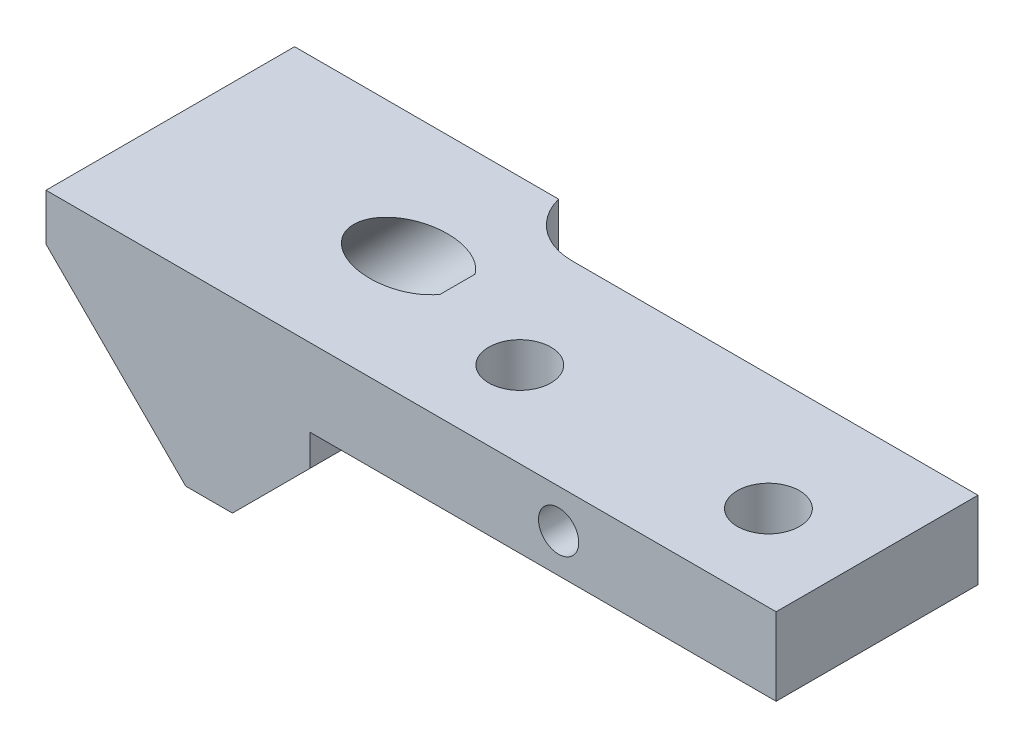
ISO-10303-21;
HEADER;
FILE_DESCRIPTION(('STEP AP214'),'2;1');
FILE_NAME('part.step','',(''),(''),'','','');
FILE_SCHEMA(('AUTOMOTIVE_DESIGN { 1 0 10303 214 1 1 1 1 }'));
ENDSEC;
DATA;
#1=APPLICATION_CONTEXT('core data for automotive mechanical design processes');
#2=APPLICATION_PROTOCOL_DEFINITION('international standard','automotive_design',2000,#1);
#3=PRODUCT_CONTEXT('',#1,'mechanical');
#4=PRODUCT('Part','Part','',(#3));
#5=PRODUCT_RELATED_PRODUCT_CATEGORY('part','',(#4));
#6=PRODUCT_DEFINITION_FORMATION('','',#4);
#7=PRODUCT_DEFINITION_CONTEXT('part definition',#1,'design');
#8=PRODUCT_DEFINITION('design','',#6,#7);
#9=PRODUCT_DEFINITION_SHAPE('','',#8);
#10=(LENGTH_UNIT() NAMED_UNIT(*) SI_UNIT(.MILLI.,.METRE.));
#11=(NAMED_UNIT(*) PLANE_ANGLE_UNIT() SI_UNIT($,.RADIAN.));
#12=(NAMED_UNIT(*) SI_UNIT($,.STERADIAN.) SOLID_ANGLE_UNIT());
#13=UNCERTAINTY_MEASURE_WITH_UNIT(LENGTH_MEASURE(1.E-05),#10,'distance_accuracy_value','');
#14=(GEOMETRIC_REPRESENTATION_CONTEXT(3) GLOBAL_UNCERTAINTY_ASSIGNED_CONTEXT((#13)) GLOBAL_UNIT_ASSIGNED_CONTEXT((#10,
#11,#12)) REPRESENTATION_CONTEXT('',''));
#15=CARTESIAN_POINT('',(0.,0.,0.));
#16=DIRECTION('',(0.,0.,1.));
#17=DIRECTION('',(1.,0.,0.));
#18=AXIS2_PLACEMENT_3D('',#15,#16,#17);
#19=CARTESIAN_POINT('',(0.,0.,12.7));
#20=DIRECTION('',(0.,0.,1.));
#21=DIRECTION('',(1.,0.,0.));
#22=AXIS2_PLACEMENT_3D('',#19,#20,#21);
#23=PLANE('',#22);
#24=DIRECTION('',(1.,0.,0.));
#25=VECTOR('',#24,1.);
#26=CARTESIAN_POINT('',(-47.625,-11.1252,12.7));
#27=LINE('',#26,#25);
#28=CARTESIAN_POINT('',(-60.325,-11.1252,12.7));
#29=VERTEX_POINT('',#28);
#30=CARTESIAN_POINT('',(-55.5498,-11.1252,12.7));
#31=VERTEX_POINT('',#30);
#32=EDGE_CURVE('E172',#29,#31,#27,.T.);
#33=ORIENTED_EDGE('',*,*,#32,.T.);
#34=DIRECTION('',(-0.707106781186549,-0.707106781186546,0.));
#35=VECTOR('',#34,1.);
#36=CARTESIAN_POINT('',(-22.2122999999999,22.2123,12.7));
#37=LINE('',#36,#35);
#38=CARTESIAN_POINT('',(-47.625,-3.20040000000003,12.7));
#39=VERTEX_POINT('',#38);
#40=EDGE_CURVE('E11',#31,#39,#37,.F.);
#41=ORIENTED_EDGE('',*,*,#40,.T.);
#42=DIRECTION('',(0.,1.,0.));
#43=VECTOR('',#42,1.);
#44=CARTESIAN_POINT('',(-47.625,0.,12.7));
#45=LINE('',#44,#43);
#46=CARTESIAN_POINT('',(-47.625,0.,12.7));
#47=VERTEX_POINT('',#46);
#48=EDGE_CURVE('E174',#39,#47,#45,.T.);
#49=ORIENTED_EDGE('',*,*,#48,.T.);
#50=DIRECTION('',(1.,0.,0.));
#51=VECTOR('',#50,1.);
#52=CARTESIAN_POINT('',(0.,0.,12.7));
#53=LINE('',#52,#51);
#54=CARTESIAN_POINT('',(0.,0.,12.7));
#55=VERTEX_POINT('',#54);
#56=EDGE_CURVE('E177',#47,#55,#53,.T.);
#57=ORIENTED_EDGE('',*,*,#56,.T.);
#58=DIRECTION('',(0.,1.,0.));
#59=VECTOR('',#58,1.);
#60=CARTESIAN_POINT('',(0.,7.9248,12.7));
#61=LINE('',#60,#59);
#62=CARTESIAN_POINT('',(0.,7.9248,12.7));
#63=VERTEX_POINT('',#62);
#64=EDGE_CURVE('E179',#55,#63,#61,.T.);
#65=ORIENTED_EDGE('',*,*,#64,.T.);
#66=DIRECTION('',(-1.,0.,0.));
#67=VECTOR('',#66,1.);
#68=CARTESIAN_POINT('',(-79.3750000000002,7.9248,12.7));
#69=LINE('',#68,#67);
#70=CARTESIAN_POINT('',(-74.5998000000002,7.9248,12.7));
#71=VERTEX_POINT('',#70);
#72=EDGE_CURVE('E181',#63,#71,#69,.T.);
#73=ORIENTED_EDGE('',*,*,#72,.T.);
#74=DIRECTION('',(0.,1.,0.));
#75=VECTOR('',#74,1.);
#76=CARTESIAN_POINT('',(-74.5998000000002,0.,12.7));
#77=LINE('',#76,#75);
#78=CARTESIAN_POINT('',(-74.5998000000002,3.14960000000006,12.7));
#79=VERTEX_POINT('',#78);
#80=EDGE_CURVE('E151',#79,#71,#77,.T.);
#81=ORIENTED_EDGE('',*,*,#80,.F.);
#82=DIRECTION('',(0.707106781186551,-0.707106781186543,0.));
#83=VECTOR('',#82,1.);
#84=CARTESIAN_POINT('',(-60.325,-11.1252,12.7));
#85=LINE('',#84,#83);
#86=EDGE_CURVE('E184',#79,#29,#85,.T.);
#87=ORIENTED_EDGE('',*,*,#86,.T.);
#88=EDGE_LOOP('',(#33,#41,#49,#57,#65,#73,#81,#87));
#89=FACE_BOUND('',#88,.T.);
#90=CARTESIAN_POINT('',(-22.225,3.9624,12.7));
#91=DIRECTION('',(0.,0.,1.));
#92=DIRECTION('',(1.,0.,0.));
#93=AXIS2_PLACEMENT_3D('',#90,#91,#92);
#94=CIRCLE('',#93,2.0574);
#95=CARTESIAN_POINT('',(-24.2824,3.9624,12.7));
#96=VERTEX_POINT('',#95);
#97=EDGE_CURVE('E138',#96,#96,#94,.F.);
#98=ORIENTED_EDGE('',*,*,#97,.T.);
#99=EDGE_LOOP('',(#98));
#100=FACE_BOUND('',#99,.T.);
#101=ADVANCED_FACE('F33',(#89,#100),#23,.T.);
#102=CARTESIAN_POINT('',(0.,0.,12.7));
#103=DIRECTION('',(0.,1.,0.));
#104=DIRECTION('',(-1.,0.,0.));
#105=AXIS2_PLACEMENT_3D('',#102,#103,#104);
#106=PLANE('',#105);
#107=CARTESIAN_POINT('',(-9.525,0.,3.9624));
#108=DIRECTION('',(0.,1.,0.));
#109=DIRECTION('',(-1.,0.,0.));
#110=AXIS2_PLACEMENT_3D('',#107,#108,#109);
#111=CIRCLE('',#110,3.175);
#112=CARTESIAN_POINT('',(-12.7,0.,3.9624));
#113=VERTEX_POINT('',#112);
#114=EDGE_CURVE('E160',#113,#113,#111,.T.);
#115=ORIENTED_EDGE('',*,*,#114,.T.);
#116=EDGE_LOOP('',(#115));
#117=FACE_BOUND('',#116,.T.);
#118=CARTESIAN_POINT('',(-34.925,0.,3.9624));
#119=DIRECTION('',(0.,1.,0.));
#120=DIRECTION('',(-1.,0.,0.));
#121=AXIS2_PLACEMENT_3D('',#118,#119,#120);
#122=CIRCLE('',#121,3.175);
#123=CARTESIAN_POINT('',(-38.1,0.,3.9624));
#124=VERTEX_POINT('',#123);
#125=EDGE_CURVE('E156',#124,#124,#122,.T.);
#126=ORIENTED_EDGE('',*,*,#125,.T.);
#127=EDGE_LOOP('',(#126));
#128=FACE_BOUND('',#127,.T.);
#129=CARTESIAN_POINT('',(-41.4733737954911,0.,-14.2748));
#130=DIRECTION('',(0.,1.,0.));
#131=DIRECTION('',(0.,0.,-1.));
#132=AXIS2_PLACEMENT_3D('',#129,#130,#131);
#133=CIRCLE('',#132,6.35);
#134=CARTESIAN_POINT('',(-47.625,0.,-12.7));
#135=VERTEX_POINT('',#134);
#136=CARTESIAN_POINT('',(-41.4733737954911,0.,-7.9248));
#137=VERTEX_POINT('',#136);
#138=EDGE_CURVE('E117',#135,#137,#133,.T.);
#139=ORIENTED_EDGE('',*,*,#138,.T.);
#140=DIRECTION('',(1.,0.,0.));
#141=VECTOR('',#140,1.);
#142=CARTESIAN_POINT('',(0.,0.,-7.9248));
#143=LINE('',#142,#141);
#144=CARTESIAN_POINT('',(0.,0.,-7.9248));
#145=VERTEX_POINT('',#144);
#146=EDGE_CURVE('E126',#137,#145,#143,.T.);
#147=ORIENTED_EDGE('',*,*,#146,.T.);
#148=DIRECTION('',(0.,0.,-1.));
#149=VECTOR('',#148,1.);
#150=CARTESIAN_POINT('',(0.,0.,12.7));
#151=LINE('',#150,#149);
#152=EDGE_CURVE('E198',#55,#145,#151,.T.);
#153=ORIENTED_EDGE('',*,*,#152,.F.);
#154=ORIENTED_EDGE('',*,*,#56,.F.);
#155=DIRECTION('',(0.,0.,-1.));
#156=VECTOR('',#155,1.);
#157=CARTESIAN_POINT('',(-47.625,0.,12.7));
#158=LINE('',#157,#156);
#159=EDGE_CURVE('E137',#47,#135,#158,.T.);
#160=ORIENTED_EDGE('',*,*,#159,.T.);
#161=EDGE_LOOP('',(#139,#147,#153,#154,#160));
#162=FACE_BOUND('',#161,.T.);
#163=ADVANCED_FACE('F134',(#117,#128,#162),#106,.F.);
#164=CARTESIAN_POINT('',(0.,7.9248,12.7));
#165=DIRECTION('',(-1.,0.,0.));
#166=DIRECTION('',(0.,-1.,0.));
#167=AXIS2_PLACEMENT_3D('',#164,#165,#166);
#168=PLANE('',#167);
#169=DIRECTION('',(0.,-1.,0.));
#170=VECTOR('',#169,1.);
#171=CARTESIAN_POINT('',(0.,8.89,-7.9248));
#172=LINE('',#171,#170);
#173=CARTESIAN_POINT('',(0.,7.9248,-7.9248));
#174=VERTEX_POINT('',#173);
#175=EDGE_CURVE('E123',#174,#145,#172,.T.);
#176=ORIENTED_EDGE('',*,*,#175,.F.);
#177=DIRECTION('',(0.,0.,-1.));
#178=VECTOR('',#177,1.);
#179=CARTESIAN_POINT('',(0.,7.9248,12.7));
#180=LINE('',#179,#178);
#181=EDGE_CURVE('E195',#63,#174,#180,.T.);
#182=ORIENTED_EDGE('',*,*,#181,.F.);
#183=ORIENTED_EDGE('',*,*,#64,.F.);
#184=ORIENTED_EDGE('',*,*,#152,.T.);
#185=EDGE_LOOP('',(#176,#182,#183,#184));
#186=FACE_BOUND('',#185,.T.);
#187=ADVANCED_FACE('F231',(#186),#168,.F.);
#188=CARTESIAN_POINT('',(-79.3750000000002,7.9248,12.7));
#189=DIRECTION('',(0.,-1.,0.));
#190=DIRECTION('',(0.,0.,-1.));
#191=AXIS2_PLACEMENT_3D('',#188,#189,#190);
#192=PLANE('',#191);
#193=DIRECTION('',(0.,0.,-1.));
#194=VECTOR('',#193,1.);
#195=CARTESIAN_POINT('',(-45.2500267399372,7.9248,12.7));
#196=LINE('',#195,#194);
#197=CARTESIAN_POINT('',(-45.2500267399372,7.9248,1.78169952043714));
#198=VERTEX_POINT('',#197);
#199=CARTESIAN_POINT('',(-45.2500267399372,7.9248,-1.78169952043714));
#200=VERTEX_POINT('',#199);
#201=EDGE_CURVE('E201',#198,#200,#196,.T.);
#202=ORIENTED_EDGE('',*,*,#201,.F.);
#203=CARTESIAN_POINT('',(-50.2552561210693,7.9248,0.));
#204=DIRECTION('',(0.,-1.,0.));
#205=DIRECTION('',(-1.,0.,0.));
#206=AXIS2_PLACEMENT_3D('',#203,#204,#205);
#207=ELLIPSE('',#206,5.60367981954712,3.9624);
#208=EDGE_CURVE('E166',#198,#200,#207,.T.);
#209=ORIENTED_EDGE('',*,*,#208,.T.);
#210=EDGE_LOOP('',(#202,#209));
#211=FACE_BOUND('',#210,.T.);
#212=CARTESIAN_POINT('',(-9.525,7.9248,3.9624));
#213=DIRECTION('',(0.,-1.,0.));
#214=DIRECTION('',(0.,0.,-1.));
#215=AXIS2_PLACEMENT_3D('',#212,#213,#214);
#216=CIRCLE('',#215,3.175);
#217=CARTESIAN_POINT('',(-9.525,7.9248,0.787399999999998));
#218=VERTEX_POINT('',#217);
#219=EDGE_CURVE('E159',#218,#218,#216,.T.);
#220=ORIENTED_EDGE('',*,*,#219,.T.);
#221=EDGE_LOOP('',(#220));
#222=FACE_BOUND('',#221,.T.);
#223=CARTESIAN_POINT('',(-34.925,7.9248,3.9624));
#224=DIRECTION('',(0.,-1.,0.));
#225=DIRECTION('',(0.,0.,-1.));
#226=AXIS2_PLACEMENT_3D('',#223,#224,#225);
#227=CIRCLE('',#226,3.175);
#228=CARTESIAN_POINT('',(-34.925,7.9248,0.787400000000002));
#229=VERTEX_POINT('',#228);
#230=EDGE_CURVE('E155',#229,#229,#227,.T.);
#231=ORIENTED_EDGE('',*,*,#230,.T.);
#232=EDGE_LOOP('',(#231));
#233=FACE_BOUND('',#232,.T.);
#234=CARTESIAN_POINT('',(-41.4733737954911,7.9248,-14.2748));
#235=DIRECTION('',(0.,-1.,0.));
#236=DIRECTION('',(0.,0.,-1.));
#237=AXIS2_PLACEMENT_3D('',#234,#235,#236);
#238=CIRCLE('',#237,6.35);
#239=CARTESIAN_POINT('',(-47.625,7.9248,-12.7));
#240=VERTEX_POINT('',#239);
#241=CARTESIAN_POINT('',(-41.4733737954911,7.9248,-7.9248));
#242=VERTEX_POINT('',#241);
#243=EDGE_CURVE('E120',#240,#242,#238,.F.);
#244=ORIENTED_EDGE('',*,*,#243,.F.);
#245=DIRECTION('',(-1.,0.,0.));
#246=VECTOR('',#245,1.);
#247=CARTESIAN_POINT('',(-79.3750000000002,7.9248,-12.7));
#248=LINE('',#247,#246);
#249=CARTESIAN_POINT('',(-74.5998000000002,7.9248,-12.7));
#250=VERTEX_POINT('',#249);
#251=EDGE_CURVE('E190',#240,#250,#248,.T.);
#252=ORIENTED_EDGE('',*,*,#251,.T.);
#253=DIRECTION('',(0.,0.,-1.));
#254=VECTOR('',#253,1.);
#255=CARTESIAN_POINT('',(-74.5998000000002,7.9248,122.736864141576));
#256=LINE('',#255,#254);
#257=EDGE_CURVE('E147',#71,#250,#256,.T.);
#258=ORIENTED_EDGE('',*,*,#257,.F.);
#259=ORIENTED_EDGE('',*,*,#72,.F.);
#260=ORIENTED_EDGE('',*,*,#181,.T.);
#261=DIRECTION('',(1.,0.,0.));
#262=VECTOR('',#261,1.);
#263=CARTESIAN_POINT('',(-79.3750000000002,7.9248,-7.92479999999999));
#264=LINE('',#263,#262);
#265=EDGE_CURVE('E212',#242,#174,#264,.T.);
#266=ORIENTED_EDGE('',*,*,#265,.F.);
#267=EDGE_LOOP('',(#244,#252,#258,#259,#260,#266));
#268=FACE_BOUND('',#267,.T.);
#269=ADVANCED_FACE('F226',(#211,#222,#233,#268),#192,.F.);
#270=CARTESIAN_POINT('',(0.,0.,-12.7));
#271=DIRECTION('',(0.,0.,1.));
#272=DIRECTION('',(1.,0.,0.));
#273=AXIS2_PLACEMENT_3D('',#270,#271,#272);
#274=PLANE('',#273);
#275=DIRECTION('',(0.,1.,0.));
#276=VECTOR('',#275,1.);
#277=CARTESIAN_POINT('',(-47.625,0.,-12.7));
#278=LINE('',#277,#276);
#279=CARTESIAN_POINT('',(-47.625,-3.20040000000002,-12.7));
#280=VERTEX_POINT('',#279);
#281=EDGE_CURVE('E188',#280,#135,#278,.T.);
#282=ORIENTED_EDGE('',*,*,#281,.F.);
#283=DIRECTION('',(0.707106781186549,0.707106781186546,0.));
#284=VECTOR('',#283,1.);
#285=CARTESIAN_POINT('',(-47.625,-3.20040000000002,-12.7));
#286=LINE('',#285,#284);
#287=CARTESIAN_POINT('',(-55.5498,-11.1252,-12.7));
#288=VERTEX_POINT('',#287);
#289=EDGE_CURVE('E55',#280,#288,#286,.F.);
#290=ORIENTED_EDGE('',*,*,#289,.T.);
#291=DIRECTION('',(1.,0.,0.));
#292=VECTOR('',#291,1.);
#293=CARTESIAN_POINT('',(-47.625,-11.1252,-12.7));
#294=LINE('',#293,#292);
#295=CARTESIAN_POINT('',(-60.325,-11.1252,-12.7));
#296=VERTEX_POINT('',#295);
#297=EDGE_CURVE('E171',#296,#288,#294,.T.);
#298=ORIENTED_EDGE('',*,*,#297,.F.);
#299=DIRECTION('',(0.707106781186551,-0.707106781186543,0.));
#300=VECTOR('',#299,1.);
#301=CARTESIAN_POINT('',(-60.325,-11.1252,-12.7));
#302=LINE('',#301,#300);
#303=CARTESIAN_POINT('',(-74.5998000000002,3.14960000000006,-12.6999999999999));
#304=VERTEX_POINT('',#303);
#305=EDGE_CURVE('E175',#304,#296,#302,.T.);
#306=ORIENTED_EDGE('',*,*,#305,.F.);
#307=DIRECTION('',(0.,1.,0.));
#308=VECTOR('',#307,1.);
#309=CARTESIAN_POINT('',(-74.5998000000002,0.,-12.7));
#310=LINE('',#309,#308);
#311=EDGE_CURVE('E203',#304,#250,#310,.T.);
#312=ORIENTED_EDGE('',*,*,#311,.T.);
#313=ORIENTED_EDGE('',*,*,#251,.F.);
#314=DIRECTION('',(0.,-1.,0.));
#315=VECTOR('',#314,1.);
#316=CARTESIAN_POINT('',(-47.625,8.89,-12.7));
#317=LINE('',#316,#315);
#318=EDGE_CURVE('E210',#135,#240,#317,.F.);
#319=ORIENTED_EDGE('',*,*,#318,.F.);
#320=EDGE_LOOP('',(#282,#290,#298,#306,#312,#313,#319));
#321=FACE_BOUND('',#320,.T.);
#322=ADVANCED_FACE('F223',(#321),#274,.F.);
#323=CARTESIAN_POINT('',(-47.625,-11.1252,12.7));
#324=DIRECTION('',(0.,1.,0.));
#325=DIRECTION('',(-1.,0.,0.));
#326=AXIS2_PLACEMENT_3D('',#323,#324,#325);
#327=PLANE('',#326);
#328=ORIENTED_EDGE('',*,*,#297,.T.);
#329=DIRECTION('',(0.,0.,1.));
#330=VECTOR('',#329,1.);
#331=CARTESIAN_POINT('',(-55.5498,-11.1252,12.7));
#332=LINE('',#331,#330);
#333=EDGE_CURVE('E41',#288,#31,#332,.T.);
#334=ORIENTED_EDGE('',*,*,#333,.T.);
#335=ORIENTED_EDGE('',*,*,#32,.F.);
#336=DIRECTION('',(0.,0.,-1.));
#337=VECTOR('',#336,1.);
#338=CARTESIAN_POINT('',(-60.325,-11.1252,12.7));
#339=LINE('',#338,#337);
#340=EDGE_CURVE('E186',#29,#296,#339,.T.);
#341=ORIENTED_EDGE('',*,*,#340,.T.);
#342=EDGE_LOOP('',(#328,#334,#335,#341));
#343=FACE_BOUND('',#342,.T.);
#344=ADVANCED_FACE('F257',(#343),#327,.F.);
#345=CARTESIAN_POINT('',(-47.625,0.,12.7));
#346=DIRECTION('',(-1.,0.,0.));
#347=DIRECTION('',(0.,0.,1.));
#348=AXIS2_PLACEMENT_3D('',#345,#346,#347);
#349=PLANE('',#348);
#350=ORIENTED_EDGE('',*,*,#48,.F.);
#351=DIRECTION('',(0.,0.,-1.));
#352=VECTOR('',#351,1.);
#353=CARTESIAN_POINT('',(-47.625,-3.20040000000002,12.7));
#354=LINE('',#353,#352);
#355=EDGE_CURVE('E213',#39,#280,#354,.T.);
#356=ORIENTED_EDGE('',*,*,#355,.T.);
#357=ORIENTED_EDGE('',*,*,#281,.T.);
#358=ORIENTED_EDGE('',*,*,#159,.F.);
#359=EDGE_LOOP('',(#350,#356,#357,#358));
#360=FACE_BOUND('',#359,.T.);
#361=ADVANCED_FACE('F220',(#360),#349,.F.);
#362=CARTESIAN_POINT('',(-60.325,-11.1252,12.7));
#363=DIRECTION('',(0.707106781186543,0.707106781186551,0.));
#364=DIRECTION('',(-0.707106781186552,0.707106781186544,0.));
#365=AXIS2_PLACEMENT_3D('',#362,#363,#364);
#366=PLANE('',#365);
#367=CARTESIAN_POINT('',(-64.8151280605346,-6.63507193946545,0.));
#368=DIRECTION('',(-0.707106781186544,-0.707106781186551,0.));
#369=DIRECTION('',(0.707106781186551,-0.707106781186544,0.));
#370=AXIS2_PLACEMENT_3D('',#367,#368,#369);
#371=CIRCLE('',#370,3.9624);
#372=CARTESIAN_POINT('',(-62.013288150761,-9.43691184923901,0.));
#373=VERTEX_POINT('',#372);
#374=EDGE_CURVE('E163',#373,#373,#371,.T.);
#375=ORIENTED_EDGE('',*,*,#374,.F.);
#376=EDGE_LOOP('',(#375));
#377=FACE_BOUND('',#376,.T.);
#378=ORIENTED_EDGE('',*,*,#86,.F.);
#379=DIRECTION('',(0.,0.,-1.));
#380=VECTOR('',#379,1.);
#381=CARTESIAN_POINT('',(-74.5998000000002,3.14960000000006,122.736864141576));
#382=LINE('',#381,#380);
#383=EDGE_CURVE('E148',#79,#304,#382,.T.);
#384=ORIENTED_EDGE('',*,*,#383,.T.);
#385=ORIENTED_EDGE('',*,*,#305,.T.);
#386=ORIENTED_EDGE('',*,*,#340,.F.);
#387=EDGE_LOOP('',(#378,#384,#385,#386));
#388=FACE_BOUND('',#387,.T.);
#389=ADVANCED_FACE('F258',(#377,#388),#366,.F.);
#390=CARTESIAN_POINT('',(-47.7526414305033,10.427414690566,0.));
#391=DIRECTION('',(-0.707106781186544,-0.707106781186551,0.));
#392=DIRECTION('',(0.707106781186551,-0.707106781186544,0.));
#393=AXIS2_PLACEMENT_3D('',#390,#391,#392);
#394=PLANE('',#393);
#395=ORIENTED_EDGE('',*,*,#201,.T.);
#396=CARTESIAN_POINT('',(-47.7526414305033,10.427414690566,0.));
#397=DIRECTION('',(-0.707106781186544,-0.707106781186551,0.));
#398=DIRECTION('',(0.707106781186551,-0.707106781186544,0.));
#399=AXIS2_PLACEMENT_3D('',#396,#397,#398);
#400=CIRCLE('',#399,3.9624);
#401=EDGE_CURVE('E164',#200,#198,#400,.T.);
#402=ORIENTED_EDGE('',*,*,#401,.T.);
#403=EDGE_LOOP('',(#395,#402));
#404=FACE_BOUND('',#403,.T.);
#405=ADVANCED_FACE('F261',(#404),#394,.T.);
#406=CARTESIAN_POINT('',(-47.7526414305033,10.427414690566,0.));
#407=DIRECTION('',(-0.707106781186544,-0.707106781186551,0.));
#408=DIRECTION('',(0.707106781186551,-0.707106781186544,0.));
#409=AXIS2_PLACEMENT_3D('',#406,#407,#408);
#410=CYLINDRICAL_SURFACE('',#409,3.9624);
#411=ORIENTED_EDGE('',*,*,#374,.T.);
#412=EDGE_LOOP('',(#411));
#413=FACE_BOUND('',#412,.T.);
#414=ORIENTED_EDGE('',*,*,#401,.F.);
#415=ORIENTED_EDGE('',*,*,#208,.F.);
#416=EDGE_LOOP('',(#414,#415));
#417=FACE_BOUND('',#416,.T.);
#418=ADVANCED_FACE('F254',(#413,#417),#410,.F.);
#419=CARTESIAN_POINT('',(-9.525,-12.7,3.9624));
#420=DIRECTION('',(0.,1.,0.));
#421=DIRECTION('',(0.,0.,1.));
#422=AXIS2_PLACEMENT_3D('',#419,#420,#421);
#423=CYLINDRICAL_SURFACE('',#422,3.175);
#424=ORIENTED_EDGE('',*,*,#219,.F.);
#425=EDGE_LOOP('',(#424));
#426=FACE_BOUND('',#425,.T.);
#427=ORIENTED_EDGE('',*,*,#114,.F.);
#428=EDGE_LOOP('',(#427));
#429=FACE_BOUND('',#428,.T.);
#430=ADVANCED_FACE('F287',(#426,#429),#423,.F.);
#431=CARTESIAN_POINT('',(-34.925,-12.7,3.9624));
#432=DIRECTION('',(0.,1.,0.));
#433=DIRECTION('',(0.,0.,1.));
#434=AXIS2_PLACEMENT_3D('',#431,#432,#433);
#435=CYLINDRICAL_SURFACE('',#434,3.175);
#436=ORIENTED_EDGE('',*,*,#230,.F.);
#437=EDGE_LOOP('',(#436));
#438=FACE_BOUND('',#437,.T.);
#439=ORIENTED_EDGE('',*,*,#125,.F.);
#440=EDGE_LOOP('',(#439));
#441=FACE_BOUND('',#440,.T.);
#442=ADVANCED_FACE('F280',(#438,#441),#435,.F.);
#443=CARTESIAN_POINT('',(-74.5998000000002,7.9248,122.736864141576));
#444=DIRECTION('',(1.,0.,0.));
#445=DIRECTION('',(0.,0.,-1.));
#446=AXIS2_PLACEMENT_3D('',#443,#444,#445);
#447=PLANE('',#446);
#448=ORIENTED_EDGE('',*,*,#383,.F.);
#449=ORIENTED_EDGE('',*,*,#80,.T.);
#450=ORIENTED_EDGE('',*,*,#257,.T.);
#451=ORIENTED_EDGE('',*,*,#311,.F.);
#452=EDGE_LOOP('',(#448,#449,#450,#451));
#453=FACE_BOUND('',#452,.T.);
#454=ADVANCED_FACE('F278',(#453),#447,.F.);
#455=CARTESIAN_POINT('',(0.,8.89,-7.9248));
#456=DIRECTION('',(0.,0.,-1.));
#457=DIRECTION('',(-1.,0.,0.));
#458=AXIS2_PLACEMENT_3D('',#455,#456,#457);
#459=PLANE('',#458);
#460=ORIENTED_EDGE('',*,*,#265,.T.);
#461=ORIENTED_EDGE('',*,*,#175,.T.);
#462=ORIENTED_EDGE('',*,*,#146,.F.);
#463=DIRECTION('',(0.,-1.,0.));
#464=VECTOR('',#463,1.);
#465=CARTESIAN_POINT('',(-41.4733737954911,8.89,-7.9248));
#466=LINE('',#465,#464);
#467=EDGE_CURVE('E113',#242,#137,#466,.T.);
#468=ORIENTED_EDGE('',*,*,#467,.F.);
#469=EDGE_LOOP('',(#460,#461,#462,#468));
#470=FACE_BOUND('',#469,.T.);
#471=ADVANCED_FACE('F127',(#470),#459,.T.);
#472=CARTESIAN_POINT('',(-41.4733737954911,8.89,-14.2748));
#473=DIRECTION('',(0.,-1.,0.));
#474=DIRECTION('',(0.,0.,-1.));
#475=AXIS2_PLACEMENT_3D('',#472,#473,#474);
#476=CYLINDRICAL_SURFACE('',#475,6.35);
#477=ORIENTED_EDGE('',*,*,#243,.T.);
#478=ORIENTED_EDGE('',*,*,#467,.T.);
#479=ORIENTED_EDGE('',*,*,#138,.F.);
#480=ORIENTED_EDGE('',*,*,#318,.T.);
#481=EDGE_LOOP('',(#477,#478,#479,#480));
#482=FACE_BOUND('',#481,.T.);
#483=ADVANCED_FACE('F115',(#482),#476,.F.);
#484=CARTESIAN_POINT('',(-22.225,3.9624,17.78));
#485=DIRECTION('',(0.,0.,-1.));
#486=DIRECTION('',(-1.,0.,0.));
#487=AXIS2_PLACEMENT_3D('',#484,#485,#486);
#488=CYLINDRICAL_SURFACE('',#487,2.0574);
#489=CARTESIAN_POINT('',(-22.225,3.9624,0.));
#490=DIRECTION('',(0.,0.,1.));
#491=DIRECTION('',(1.,0.,0.));
#492=AXIS2_PLACEMENT_3D('',#489,#490,#491);
#493=CIRCLE('',#492,2.0574);
#494=CARTESIAN_POINT('',(-24.2824,3.9624,0.));
#495=VERTEX_POINT('',#494);
#496=EDGE_CURVE('E141',#495,#495,#493,.T.);
#497=CARTESIAN_POINT('',(-24.2824,3.9624,12.7));
#498=CARTESIAN_POINT('',(-24.2824,3.9624,12.5677083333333));
#499=CARTESIAN_POINT('',(-24.2824,3.9624,12.4354166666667));
#500=CARTESIAN_POINT('',(-24.2824,3.9624,12.1708333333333));
#501=CARTESIAN_POINT('',(-24.2824,3.9624,12.0385416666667));
#502=CARTESIAN_POINT('',(-24.2824,3.9624,11.7739583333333));
#503=CARTESIAN_POINT('',(-24.2824,3.9624,11.6416666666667));
#504=CARTESIAN_POINT('',(-24.2824,3.9624,11.3770833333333));
#505=CARTESIAN_POINT('',(-24.2824,3.9624,11.2447916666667));
#506=CARTESIAN_POINT('',(-24.2824,3.9624,10.9802083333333));
#507=CARTESIAN_POINT('',(-24.2824,3.9624,10.8479166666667));
#508=CARTESIAN_POINT('',(-24.2824,3.9624,10.5833333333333));
#509=CARTESIAN_POINT('',(-24.2824,3.9624,10.4510416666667));
#510=CARTESIAN_POINT('',(-24.2824,3.9624,10.1864583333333));
#511=CARTESIAN_POINT('',(-24.2824,3.9624,10.0541666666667));
#512=CARTESIAN_POINT('',(-24.2824,3.9624,9.78958333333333));
#513=CARTESIAN_POINT('',(-24.2824,3.9624,9.65729166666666));
#514=CARTESIAN_POINT('',(-24.2824,3.9624,9.39270833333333));
#515=CARTESIAN_POINT('',(-24.2824,3.9624,9.26041666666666));
#516=CARTESIAN_POINT('',(-24.2824,3.9624,8.99583333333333));
#517=CARTESIAN_POINT('',(-24.2824,3.9624,8.86354166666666));
#518=CARTESIAN_POINT('',(-24.2824,3.9624,8.59895833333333));
#519=CARTESIAN_POINT('',(-24.2824,3.9624,8.46666666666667));
#520=CARTESIAN_POINT('',(-24.2824,3.9624,8.20208333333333));
#521=CARTESIAN_POINT('',(-24.2824,3.9624,8.06979166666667));
#522=CARTESIAN_POINT('',(-24.2824,3.9624,7.80520833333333));
#523=CARTESIAN_POINT('',(-24.2824,3.9624,7.67291666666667));
#524=CARTESIAN_POINT('',(-24.2824,3.9624,7.40833333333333));
#525=CARTESIAN_POINT('',(-24.2824,3.9624,7.27604166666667));
#526=CARTESIAN_POINT('',(-24.2824,3.9624,7.01145833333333));
#527=CARTESIAN_POINT('',(-24.2824,3.9624,6.87916666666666));
#528=CARTESIAN_POINT('',(-24.2824,3.9624,6.61458333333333));
#529=CARTESIAN_POINT('',(-24.2824,3.9624,6.48229166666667));
#530=CARTESIAN_POINT('',(-24.2824,3.9624,6.21770833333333));
#531=CARTESIAN_POINT('',(-24.2824,3.9624,6.08541666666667));
#532=CARTESIAN_POINT('',(-24.2824,3.9624,5.82083333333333));
#533=CARTESIAN_POINT('',(-24.2824,3.9624,5.68854166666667));
#534=CARTESIAN_POINT('',(-24.2824,3.9624,5.42395833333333));
#535=CARTESIAN_POINT('',(-24.2824,3.9624,5.29166666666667));
#536=CARTESIAN_POINT('',(-24.2824,3.9624,5.02708333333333));
#537=CARTESIAN_POINT('',(-24.2824,3.9624,4.89479166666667));
#538=CARTESIAN_POINT('',(-24.2824,3.9624,4.63020833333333));
#539=CARTESIAN_POINT('',(-24.2824,3.9624,4.49791666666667));
#540=CARTESIAN_POINT('',(-24.2824,3.9624,4.23333333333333));
#541=CARTESIAN_POINT('',(-24.2824,3.9624,4.10104166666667));
#542=CARTESIAN_POINT('',(-24.2824,3.9624,3.83645833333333));
#543=CARTESIAN_POINT('',(-24.2824,3.9624,3.70416666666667));
#544=CARTESIAN_POINT('',(-24.2824,3.9624,3.43958333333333));
#545=CARTESIAN_POINT('',(-24.2824,3.9624,3.30729166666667));
#546=CARTESIAN_POINT('',(-24.2824,3.9624,3.04270833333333));
#547=CARTESIAN_POINT('',(-24.2824,3.9624,2.91041666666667));
#548=CARTESIAN_POINT('',(-24.2824,3.9624,2.64583333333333));
#549=CARTESIAN_POINT('',(-24.2824,3.9624,2.51354166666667));
#550=CARTESIAN_POINT('',(-24.2824,3.9624,2.24895833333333));
#551=CARTESIAN_POINT('',(-24.2824,3.9624,2.11666666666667));
#552=CARTESIAN_POINT('',(-24.2824,3.9624,1.85208333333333));
#553=CARTESIAN_POINT('',(-24.2824,3.9624,1.71979166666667));
#554=CARTESIAN_POINT('',(-24.2824,3.9624,1.45520833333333));
#555=CARTESIAN_POINT('',(-24.2824,3.9624,1.32291666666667));
#556=CARTESIAN_POINT('',(-24.2824,3.9624,1.05833333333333));
#557=CARTESIAN_POINT('',(-24.2824,3.9624,0.926041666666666));
#558=CARTESIAN_POINT('',(-24.2824,3.9624,0.661458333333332));
#559=CARTESIAN_POINT('',(-24.2824,3.9624,0.529166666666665));
#560=CARTESIAN_POINT('',(-24.2824,3.9624,0.264583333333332));
#561=CARTESIAN_POINT('',(-24.2824,3.9624,0.132291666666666));
#562=CARTESIAN_POINT('',(-24.2824,3.9624,0.));
#563=B_SPLINE_CURVE_WITH_KNOTS('',3,(#497,#498,#499,#500,#501,#502,#503,#504,#505,#506,#507,
#508,#509,#510,#511,#512,#513,#514,#515,#516,#517,#518,#519,#520,#521,#522,#523,#524,#525,#526,
#527,#528,#529,#530,#531,#532,#533,#534,#535,#536,#537,#538,#539,#540,#541,#542,#543,#544,#545,
#546,#547,#548,#549,#550,#551,#552,#553,#554,#555,#556,#557,#558,#559,#560,#561,#562),
.UNSPECIFIED.,.F.,.F.,(4,2,2,2,2,2,2,2,2,2,2,2,2,2,2,2,2,2,2,2,2,2,2,2,2,2,2,2,2,2,2,2,4),(0.,
0.396875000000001,0.793750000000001,1.190625,1.5875,1.984375,2.38125,2.778125,3.175,3.571875,
3.96875,4.365625,4.7625,5.159375,5.55625,5.953125,6.35,6.746875,7.14375,7.540625,7.9375,
8.334375,8.73125,9.128125,9.525,9.921875,10.31875,10.715625,11.1125,11.509375,11.90625,
12.303125,12.7),.UNSPECIFIED.);
#564=EDGE_CURVE('BSEAM240',#96,#495,#563,.T.);
#565=ORIENTED_EDGE('',*,*,#97,.F.);
#566=ORIENTED_EDGE('',*,*,#496,.F.);
#567=ORIENTED_EDGE('',*,*,#564,.T.);
#568=ORIENTED_EDGE('',*,*,#564,.F.);
#569=EDGE_LOOP('',(#565,#567,#566,#568));
#570=FACE_BOUND('',#569,.T.);
#571=ADVANCED_FACE('F240',(#570),#488,.F.);
#572=CARTESIAN_POINT('',(-22.225,3.9624,0.));
#573=DIRECTION('',(0.,0.,1.));
#574=DIRECTION('',(1.,0.,0.));
#575=AXIS2_PLACEMENT_3D('',#572,#573,#574);
#576=PLANE('',#575);
#577=ORIENTED_EDGE('',*,*,#496,.T.);
#578=EDGE_LOOP('',(#577));
#579=FACE_BOUND('',#578,.T.);
#580=ADVANCED_FACE('F236',(#579),#576,.T.);
#581=CARTESIAN_POINT('',(-47.625,-3.20040000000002,12.7));
#582=DIRECTION('',(-0.707106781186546,0.707106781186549,0.));
#583=DIRECTION('',(0.,0.,-1.));
#584=AXIS2_PLACEMENT_3D('',#581,#582,#583);
#585=PLANE('',#584);
#586=ORIENTED_EDGE('',*,*,#40,.F.);
#587=ORIENTED_EDGE('',*,*,#333,.F.);
#588=ORIENTED_EDGE('',*,*,#289,.F.);
#589=ORIENTED_EDGE('',*,*,#355,.F.);
#590=EDGE_LOOP('',(#586,#587,#588,#589));
#591=FACE_BOUND('',#590,.T.);
#592=ADVANCED_FACE('F35',(#591),#585,.F.);
#593=CLOSED_SHELL('',(#101,#163,#187,#269,#322,#344,#361,#389,#405,#418,#430,#442,#454,#471,
#483,#571,#580,#592));
#594=MANIFOLD_SOLID_BREP('B2',#593);
#595=ADVANCED_BREP_SHAPE_REPRESENTATION('',(#18,#594),#14);
#596=SHAPE_DEFINITION_REPRESENTATION(#9,#595);
ENDSEC;
END-ISO-10303-21;
